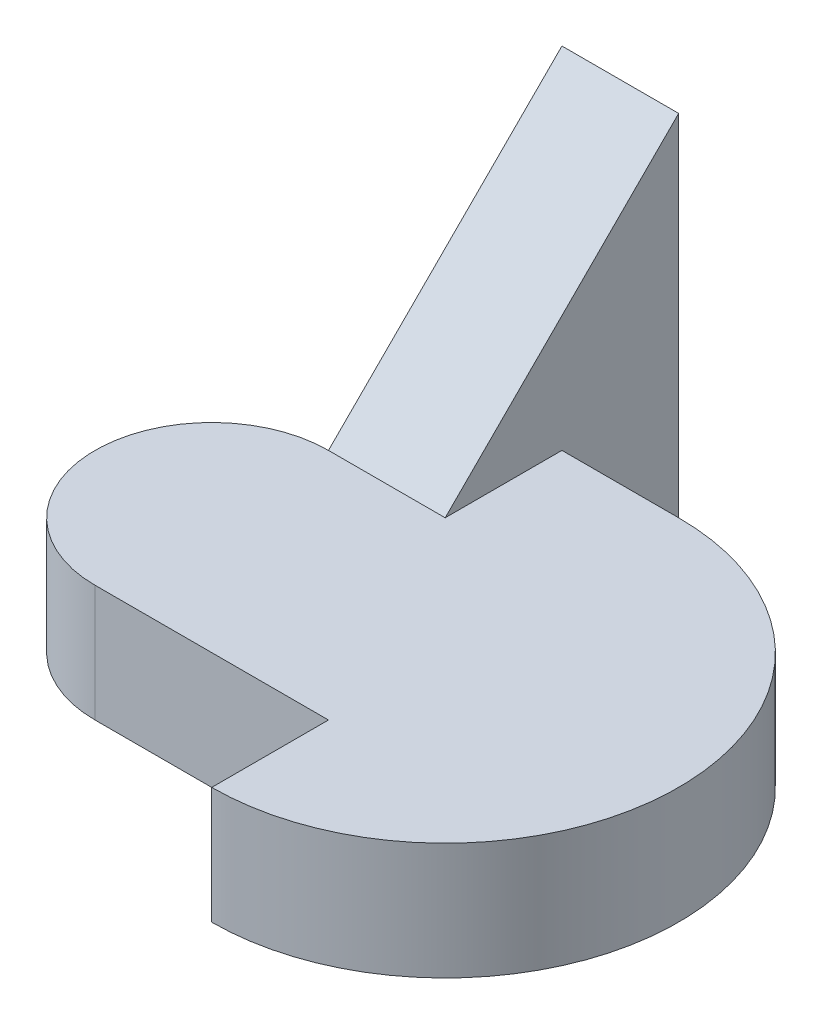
ISO-10303-21;
HEADER;
FILE_DESCRIPTION(('STEP AP214'),'2;1');
FILE_NAME('part.step','',(''),(''),'','','');
FILE_SCHEMA(('AUTOMOTIVE_DESIGN { 1 0 10303 214 1 1 1 1 }'));
ENDSEC;
DATA;
#1=APPLICATION_CONTEXT('core data for automotive mechanical design processes');
#2=APPLICATION_PROTOCOL_DEFINITION('international standard','automotive_design',2000,#1);
#3=PRODUCT_CONTEXT('',#1,'mechanical');
#4=PRODUCT('Part','Part','',(#3));
#5=PRODUCT_RELATED_PRODUCT_CATEGORY('part','',(#4));
#6=PRODUCT_DEFINITION_FORMATION('','',#4);
#7=PRODUCT_DEFINITION_CONTEXT('part definition',#1,'design');
#8=PRODUCT_DEFINITION('design','',#6,#7);
#9=PRODUCT_DEFINITION_SHAPE('','',#8);
#10=(LENGTH_UNIT() NAMED_UNIT(*) SI_UNIT(.MILLI.,.METRE.));
#11=(NAMED_UNIT(*) PLANE_ANGLE_UNIT() SI_UNIT($,.RADIAN.));
#12=(NAMED_UNIT(*) SI_UNIT($,.STERADIAN.) SOLID_ANGLE_UNIT());
#13=UNCERTAINTY_MEASURE_WITH_UNIT(LENGTH_MEASURE(1.E-05),#10,'distance_accuracy_value','');
#14=(GEOMETRIC_REPRESENTATION_CONTEXT(3) GLOBAL_UNCERTAINTY_ASSIGNED_CONTEXT((#13)) GLOBAL_UNIT_ASSIGNED_CONTEXT((#10,
#11,#12)) REPRESENTATION_CONTEXT('',''));
#15=CARTESIAN_POINT('',(0.,0.,0.));
#16=DIRECTION('',(0.,0.,1.));
#17=DIRECTION('',(1.,0.,0.));
#18=AXIS2_PLACEMENT_3D('',#15,#16,#17);
#19=CARTESIAN_POINT('',(20.,10.,-3.05047926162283));
#20=DIRECTION('',(1.,0.,0.));
#21=DIRECTION('',(0.,0.,-1.));
#22=AXIS2_PLACEMENT_3D('',#19,#20,#21);
#23=PLANE('',#22);
#24=DIRECTION('',(0.,0.,1.));
#25=VECTOR('',#24,1.);
#26=CARTESIAN_POINT('',(20.,0.,-3.05047926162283));
#27=LINE('',#26,#25);
#28=CARTESIAN_POINT('',(20.,0.,10.));
#29=VERTEX_POINT('',#28);
#30=CARTESIAN_POINT('',(20.,0.,20.));
#31=VERTEX_POINT('',#30);
#32=EDGE_CURVE('E125',#29,#31,#27,.T.);
#33=ORIENTED_EDGE('',*,*,#32,.T.);
#34=DIRECTION('',(0.,-1.,0.));
#35=VECTOR('',#34,1.);
#36=CARTESIAN_POINT('',(20.,10.,20.));
#37=LINE('',#36,#35);
#38=CARTESIAN_POINT('',(20.,10.,20.));
#39=VERTEX_POINT('',#38);
#40=EDGE_CURVE('E11',#39,#31,#37,.T.);
#41=ORIENTED_EDGE('',*,*,#40,.F.);
#42=DIRECTION('',(0.,0.,1.));
#43=VECTOR('',#42,1.);
#44=CARTESIAN_POINT('',(20.,10.,-3.05047926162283));
#45=LINE('',#44,#43);
#46=CARTESIAN_POINT('',(20.,10.,10.));
#47=VERTEX_POINT('',#46);
#48=EDGE_CURVE('E134',#47,#39,#45,.T.);
#49=ORIENTED_EDGE('',*,*,#48,.F.);
#50=DIRECTION('',(0.,-1.,0.));
#51=VECTOR('',#50,1.);
#52=CARTESIAN_POINT('',(20.,10.,10.));
#53=LINE('',#52,#51);
#54=EDGE_CURVE('E124',#47,#29,#53,.T.);
#55=ORIENTED_EDGE('',*,*,#54,.T.);
#56=EDGE_LOOP('',(#33,#41,#49,#55));
#57=FACE_BOUND('',#56,.T.);
#58=ADVANCED_FACE('F32',(#57),#23,.F.);
#59=CARTESIAN_POINT('',(20.,10.,0.));
#60=DIRECTION('',(0.,-1.,0.));
#61=DIRECTION('',(0.,0.,-1.));
#62=AXIS2_PLACEMENT_3D('',#59,#60,#61);
#63=CYLINDRICAL_SURFACE('',#62,20.);
#64=CARTESIAN_POINT('',(20.,0.,0.));
#65=DIRECTION('',(0.,1.,0.));
#66=DIRECTION('',(0.,0.,1.));
#67=AXIS2_PLACEMENT_3D('',#64,#65,#66);
#68=CIRCLE('',#67,20.);
#69=CARTESIAN_POINT('',(20.,0.,-20.));
#70=VERTEX_POINT('',#69);
#71=EDGE_CURVE('E128',#31,#70,#68,.T.);
#72=ORIENTED_EDGE('',*,*,#71,.T.);
#73=DIRECTION('',(0.,-1.,0.));
#74=VECTOR('',#73,1.);
#75=CARTESIAN_POINT('',(20.,10.,-20.));
#76=LINE('',#75,#74);
#77=CARTESIAN_POINT('',(20.,10.,-20.));
#78=VERTEX_POINT('',#77);
#79=EDGE_CURVE('E40',#78,#70,#76,.T.);
#80=ORIENTED_EDGE('',*,*,#79,.F.);
#81=CARTESIAN_POINT('',(20.,10.,0.));
#82=DIRECTION('',(0.,1.,0.));
#83=DIRECTION('',(0.,0.,1.));
#84=AXIS2_PLACEMENT_3D('',#81,#82,#83);
#85=CIRCLE('',#84,20.);
#86=EDGE_CURVE('E83',#39,#78,#85,.T.);
#87=ORIENTED_EDGE('',*,*,#86,.F.);
#88=ORIENTED_EDGE('',*,*,#40,.T.);
#89=EDGE_LOOP('',(#72,#80,#87,#88));
#90=FACE_BOUND('',#89,.T.);
#91=ADVANCED_FACE('F164',(#90),#63,.T.);
#92=CARTESIAN_POINT('',(-36.8062143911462,10.,-20.));
#93=DIRECTION('',(0.,0.,1.));
#94=DIRECTION('',(1.,0.,0.));
#95=AXIS2_PLACEMENT_3D('',#92,#93,#94);
#96=PLANE('',#95);
#97=DIRECTION('',(-1.,0.,0.));
#98=VECTOR('',#97,1.);
#99=CARTESIAN_POINT('',(-36.8062143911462,0.,-20.));
#100=LINE('',#99,#98);
#101=CARTESIAN_POINT('',(10.,0.,-20.));
#102=VERTEX_POINT('',#101);
#103=EDGE_CURVE('E105',#70,#102,#100,.T.);
#104=ORIENTED_EDGE('',*,*,#103,.T.);
#105=DIRECTION('',(0.,-1.,0.));
#106=VECTOR('',#105,1.);
#107=CARTESIAN_POINT('',(10.,10.,-20.));
#108=LINE('',#107,#106);
#109=CARTESIAN_POINT('',(10.,10.,-20.));
#110=VERTEX_POINT('',#109);
#111=EDGE_CURVE('E102',#110,#102,#108,.T.);
#112=ORIENTED_EDGE('',*,*,#111,.F.);
#113=DIRECTION('',(-1.,0.,0.));
#114=VECTOR('',#113,1.);
#115=CARTESIAN_POINT('',(-36.8062143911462,10.,-20.));
#116=LINE('',#115,#114);
#117=EDGE_CURVE('E91',#78,#110,#116,.T.);
#118=ORIENTED_EDGE('',*,*,#117,.F.);
#119=ORIENTED_EDGE('',*,*,#79,.T.);
#120=EDGE_LOOP('',(#104,#112,#118,#119));
#121=FACE_BOUND('',#120,.T.);
#122=ADVANCED_FACE('F103',(#121),#96,.F.);
#123=CARTESIAN_POINT('',(0.,10.,0.));
#124=DIRECTION('',(0.,-1.,0.));
#125=DIRECTION('',(0.,0.,-1.));
#126=AXIS2_PLACEMENT_3D('',#123,#124,#125);
#127=CYLINDRICAL_SURFACE('',#126,10.);
#128=CARTESIAN_POINT('',(0.,0.,0.));
#129=DIRECTION('',(0.,1.,0.));
#130=DIRECTION('',(0.,0.,1.));
#131=AXIS2_PLACEMENT_3D('',#128,#129,#130);
#132=CIRCLE('',#131,10.);
#133=CARTESIAN_POINT('',(0.,0.,-10.));
#134=VERTEX_POINT('',#133);
#135=CARTESIAN_POINT('',(0.,0.,10.));
#136=VERTEX_POINT('',#135);
#137=EDGE_CURVE('E69',#134,#136,#132,.T.);
#138=ORIENTED_EDGE('',*,*,#137,.T.);
#139=DIRECTION('',(0.,-1.,0.));
#140=VECTOR('',#139,1.);
#141=CARTESIAN_POINT('',(0.,10.,10.));
#142=LINE('',#141,#140);
#143=CARTESIAN_POINT('',(0.,10.,10.));
#144=VERTEX_POINT('',#143);
#145=EDGE_CURVE('E136',#144,#136,#142,.T.);
#146=ORIENTED_EDGE('',*,*,#145,.F.);
#147=CARTESIAN_POINT('',(0.,10.,0.));
#148=DIRECTION('',(0.,1.,0.));
#149=DIRECTION('',(0.,0.,1.));
#150=AXIS2_PLACEMENT_3D('',#147,#148,#149);
#151=CIRCLE('',#150,10.);
#152=CARTESIAN_POINT('',(0.,10.,-10.));
#153=VERTEX_POINT('',#152);
#154=EDGE_CURVE('E118',#153,#144,#151,.T.);
#155=ORIENTED_EDGE('',*,*,#154,.F.);
#156=DIRECTION('',(0.,-1.,0.));
#157=VECTOR('',#156,1.);
#158=CARTESIAN_POINT('',(0.,10.,-10.));
#159=LINE('',#158,#157);
#160=EDGE_CURVE('E109',#153,#134,#159,.T.);
#161=ORIENTED_EDGE('',*,*,#160,.T.);
#162=EDGE_LOOP('',(#138,#146,#155,#161));
#163=FACE_BOUND('',#162,.T.);
#164=ADVANCED_FACE('F170',(#163),#127,.T.);
#165=CARTESIAN_POINT('',(-36.8062143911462,10.,10.));
#166=DIRECTION('',(0.,0.,-1.));
#167=DIRECTION('',(-1.,0.,0.));
#168=AXIS2_PLACEMENT_3D('',#165,#166,#167);
#169=PLANE('',#168);
#170=DIRECTION('',(1.,0.,0.));
#171=VECTOR('',#170,1.);
#172=CARTESIAN_POINT('',(-36.8062143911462,0.,10.));
#173=LINE('',#172,#171);
#174=EDGE_CURVE('E75',#136,#29,#173,.T.);
#175=ORIENTED_EDGE('',*,*,#174,.T.);
#176=ORIENTED_EDGE('',*,*,#54,.F.);
#177=DIRECTION('',(1.,0.,0.));
#178=VECTOR('',#177,1.);
#179=CARTESIAN_POINT('',(-36.8062143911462,10.,10.));
#180=LINE('',#179,#178);
#181=EDGE_CURVE('E48',#144,#47,#180,.T.);
#182=ORIENTED_EDGE('',*,*,#181,.F.);
#183=ORIENTED_EDGE('',*,*,#145,.T.);
#184=EDGE_LOOP('',(#175,#176,#182,#183));
#185=FACE_BOUND('',#184,.T.);
#186=ADVANCED_FACE('F175',(#185),#169,.F.);
#187=CARTESIAN_POINT('',(-36.8062143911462,10.,-3.05047926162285));
#188=DIRECTION('',(0.,1.,0.));
#189=DIRECTION('',(0.,0.,1.));
#190=AXIS2_PLACEMENT_3D('',#187,#188,#189);
#191=PLANE('',#190);
#192=DIRECTION('',(0.,0.,1.));
#193=VECTOR('',#192,1.);
#194=CARTESIAN_POINT('',(9.99999999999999,10.,-3.05047926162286));
#195=LINE('',#194,#193);
#196=CARTESIAN_POINT('',(9.99999999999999,10.,-10.));
#197=VERTEX_POINT('',#196);
#198=EDGE_CURVE('E97',#110,#197,#195,.T.);
#199=ORIENTED_EDGE('',*,*,#198,.T.);
#200=DIRECTION('',(-1.,0.,0.));
#201=VECTOR('',#200,1.);
#202=CARTESIAN_POINT('',(-36.8062143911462,10.,-10.));
#203=LINE('',#202,#201);
#204=EDGE_CURVE('E116',#197,#153,#203,.T.);
#205=ORIENTED_EDGE('',*,*,#204,.T.);
#206=ORIENTED_EDGE('',*,*,#154,.T.);
#207=ORIENTED_EDGE('',*,*,#181,.T.);
#208=ORIENTED_EDGE('',*,*,#48,.T.);
#209=ORIENTED_EDGE('',*,*,#86,.T.);
#210=ORIENTED_EDGE('',*,*,#117,.T.);
#211=EDGE_LOOP('',(#199,#205,#206,#207,#208,#209,#210));
#212=FACE_BOUND('',#211,.T.);
#213=ADVANCED_FACE('F93',(#212),#191,.T.);
#214=CARTESIAN_POINT('',(-36.8062143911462,0.,-3.05047926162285));
#215=DIRECTION('',(0.,1.,0.));
#216=DIRECTION('',(0.,0.,1.));
#217=AXIS2_PLACEMENT_3D('',#214,#215,#216);
#218=PLANE('',#217);
#219=ORIENTED_EDGE('',*,*,#32,.F.);
#220=ORIENTED_EDGE('',*,*,#174,.F.);
#221=ORIENTED_EDGE('',*,*,#137,.F.);
#222=DIRECTION('',(0.,0.,-1.));
#223=VECTOR('',#222,1.);
#224=CARTESIAN_POINT('',(0.,0.,-3.05047926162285));
#225=LINE('',#224,#223);
#226=CARTESIAN_POINT('',(0.,0.,-30.));
#227=VERTEX_POINT('',#226);
#228=EDGE_CURVE('E148',#134,#227,#225,.T.);
#229=ORIENTED_EDGE('',*,*,#228,.T.);
#230=DIRECTION('',(1.,0.,0.));
#231=VECTOR('',#230,1.);
#232=CARTESIAN_POINT('',(-36.8062143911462,0.,-30.));
#233=LINE('',#232,#231);
#234=CARTESIAN_POINT('',(9.99999999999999,0.,-30.));
#235=VERTEX_POINT('',#234);
#236=EDGE_CURVE('E146',#227,#235,#233,.T.);
#237=ORIENTED_EDGE('',*,*,#236,.T.);
#238=DIRECTION('',(0.,0.,1.));
#239=VECTOR('',#238,1.);
#240=CARTESIAN_POINT('',(10.,0.,-3.05047926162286));
#241=LINE('',#240,#239);
#242=EDGE_CURVE('E142',#235,#102,#241,.T.);
#243=ORIENTED_EDGE('',*,*,#242,.T.);
#244=ORIENTED_EDGE('',*,*,#103,.F.);
#245=ORIENTED_EDGE('',*,*,#71,.F.);
#246=EDGE_LOOP('',(#219,#220,#221,#229,#237,#243,#244,#245));
#247=FACE_BOUND('',#246,.T.);
#248=ADVANCED_FACE('F140',(#247),#218,.F.);
#249=CARTESIAN_POINT('',(10.,30.,-3.05047926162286));
#250=DIRECTION('',(1.,0.,0.));
#251=DIRECTION('',(0.,0.,-1.));
#252=AXIS2_PLACEMENT_3D('',#249,#250,#251);
#253=PLANE('',#252);
#254=DIRECTION('',(0.,0.707106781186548,-0.707106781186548));
#255=VECTOR('',#254,1.);
#256=CARTESIAN_POINT('',(10.,16.5252396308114,-16.5252396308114));
#257=LINE('',#256,#255);
#258=CARTESIAN_POINT('',(9.99999999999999,30.,-30.));
#259=VERTEX_POINT('',#258);
#260=EDGE_CURVE('E115',#197,#259,#257,.T.);
#261=ORIENTED_EDGE('',*,*,#260,.F.);
#262=ORIENTED_EDGE('',*,*,#198,.F.);
#263=ORIENTED_EDGE('',*,*,#111,.T.);
#264=ORIENTED_EDGE('',*,*,#242,.F.);
#265=DIRECTION('',(0.,-1.,0.));
#266=VECTOR('',#265,1.);
#267=CARTESIAN_POINT('',(9.99999999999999,30.,-30.));
#268=LINE('',#267,#266);
#269=EDGE_CURVE('E129',#259,#235,#268,.T.);
#270=ORIENTED_EDGE('',*,*,#269,.F.);
#271=EDGE_LOOP('',(#261,#262,#263,#264,#270));
#272=FACE_BOUND('',#271,.T.);
#273=ADVANCED_FACE('F112',(#272),#253,.T.);
#274=CARTESIAN_POINT('',(-36.8062143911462,30.,-30.));
#275=DIRECTION('',(0.,0.,-1.));
#276=DIRECTION('',(-1.,0.,0.));
#277=AXIS2_PLACEMENT_3D('',#274,#275,#276);
#278=PLANE('',#277);
#279=ORIENTED_EDGE('',*,*,#236,.F.);
#280=DIRECTION('',(0.,-1.,0.));
#281=VECTOR('',#280,1.);
#282=CARTESIAN_POINT('',(0.,30.,-30.));
#283=LINE('',#282,#281);
#284=CARTESIAN_POINT('',(0.,30.,-30.));
#285=VERTEX_POINT('',#284);
#286=EDGE_CURVE('E156',#285,#227,#283,.T.);
#287=ORIENTED_EDGE('',*,*,#286,.F.);
#288=DIRECTION('',(1.,0.,0.));
#289=VECTOR('',#288,1.);
#290=CARTESIAN_POINT('',(-36.8062143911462,30.,-30.));
#291=LINE('',#290,#289);
#292=EDGE_CURVE('E153',#285,#259,#291,.T.);
#293=ORIENTED_EDGE('',*,*,#292,.T.);
#294=ORIENTED_EDGE('',*,*,#269,.T.);
#295=EDGE_LOOP('',(#279,#287,#293,#294));
#296=FACE_BOUND('',#295,.T.);
#297=ADVANCED_FACE('F184',(#296),#278,.T.);
#298=CARTESIAN_POINT('',(0.,30.,-3.05047926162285));
#299=DIRECTION('',(-1.,0.,0.));
#300=DIRECTION('',(0.,0.,1.));
#301=AXIS2_PLACEMENT_3D('',#298,#299,#300);
#302=PLANE('',#301);
#303=DIRECTION('',(0.,-0.707106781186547,0.707106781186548));
#304=VECTOR('',#303,1.);
#305=CARTESIAN_POINT('',(0.,30.,-30.));
#306=LINE('',#305,#304);
#307=EDGE_CURVE('E150',#285,#153,#306,.T.);
#308=ORIENTED_EDGE('',*,*,#307,.F.);
#309=ORIENTED_EDGE('',*,*,#286,.T.);
#310=ORIENTED_EDGE('',*,*,#228,.F.);
#311=ORIENTED_EDGE('',*,*,#160,.F.);
#312=EDGE_LOOP('',(#308,#309,#310,#311));
#313=FACE_BOUND('',#312,.T.);
#314=ADVANCED_FACE('F187',(#313),#302,.T.);
#315=CARTESIAN_POINT('',(40.,30.,-30.));
#316=DIRECTION('',(0.,-0.707106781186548,-0.707106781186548));
#317=DIRECTION('',(0.,0.707106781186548,-0.707106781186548));
#318=AXIS2_PLACEMENT_3D('',#315,#316,#317);
#319=PLANE('',#318);
#320=ORIENTED_EDGE('',*,*,#260,.T.);
#321=ORIENTED_EDGE('',*,*,#292,.F.);
#322=ORIENTED_EDGE('',*,*,#307,.T.);
#323=ORIENTED_EDGE('',*,*,#204,.F.);
#324=EDGE_LOOP('',(#320,#321,#322,#323));
#325=FACE_BOUND('',#324,.T.);
#326=ADVANCED_FACE('F191',(#325),#319,.F.);
#327=CLOSED_SHELL('',(#58,#91,#122,#164,#186,#213,#248,#273,#297,#314,#326));
#328=MANIFOLD_SOLID_BREP('B2',#327);
#329=ADVANCED_BREP_SHAPE_REPRESENTATION('',(#18,#328),#14);
#330=SHAPE_DEFINITION_REPRESENTATION(#9,#329);
ENDSEC;
END-ISO-10303-21;
